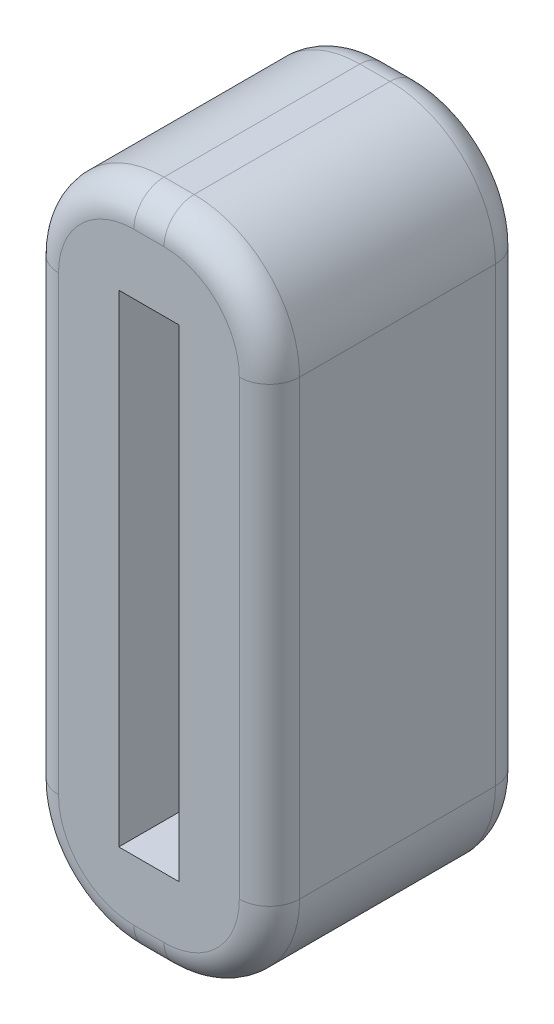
from build123d import *

# Parameters (mm, degrees)
SKETCH1_W           = 1
SKETCH1_H           = 8
BOSS_EXTRUDE1_DEPTH = 4.25
FILLET1_R           = 0.5


with BuildPart() as part:
    # Sketch1 → Boss-Extrude1 (new body)
    with BuildSketch(Plane.XY):
        with BuildLine():
            Line((-1.5, 0.25), (-1.5, 7.75))
            ThreePointArc((-1.5, 7.75), (-0.987436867, 8.987436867), (0.25, 9.5))
            Line((0.25, 9.5), (0.75, 9.5))
            ThreePointArc((0.75, 9.5), (1.987436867, 8.987436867), (2.5, 7.75))
            Line((2.5, 7.75), (2.5, 0.25))
            ThreePointArc((2.5, 0.25), (1.987436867, -0.987436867), (0.75, -1.5))
            Line((0.75, -1.5), (0.25, -1.5))
            ThreePointArc((0.25, -1.5), (-0.987436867, -0.987436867), (-1.5, 0.25))
        make_face()
        with Locations((0.5, 4)):
            Rectangle(SKETCH1_W, SKETCH1_H, mode=Mode.SUBTRACT)
    extrude(amount=BOSS_EXTRUDE1_DEPTH)

    # Fillet1
    fillet1_edges = [part.edges().sort_by_distance(p)[0] for p in [
        (1.987436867, 8.987436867, 4.25),
        (2.5, 4, 0),
        (1.987436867, -0.987436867, 0),
        (0.5, 9.5, 4.25),
        (-0.987436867, 8.987436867, 4.25),
        (-1.5, 4, 4.25),
        (-0.987436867, -0.987436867, 4.25),
        (0.5, -1.5, 4.25),
        (1.987436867, -0.987436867, 4.25),
        (2.5, 4, 4.25),
        (0.5, -1.5, 0),
        (-0.987436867, -0.987436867, 0),
        (-1.5, 4, 0),
        (-0.987436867, 8.987436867, 0),
        (0.5, 9.5, 0),
        (1.987436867, 8.987436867, 0),
    ]]
    fillet(fillet1_edges, radius=FILLET1_R)


solid = part.part
